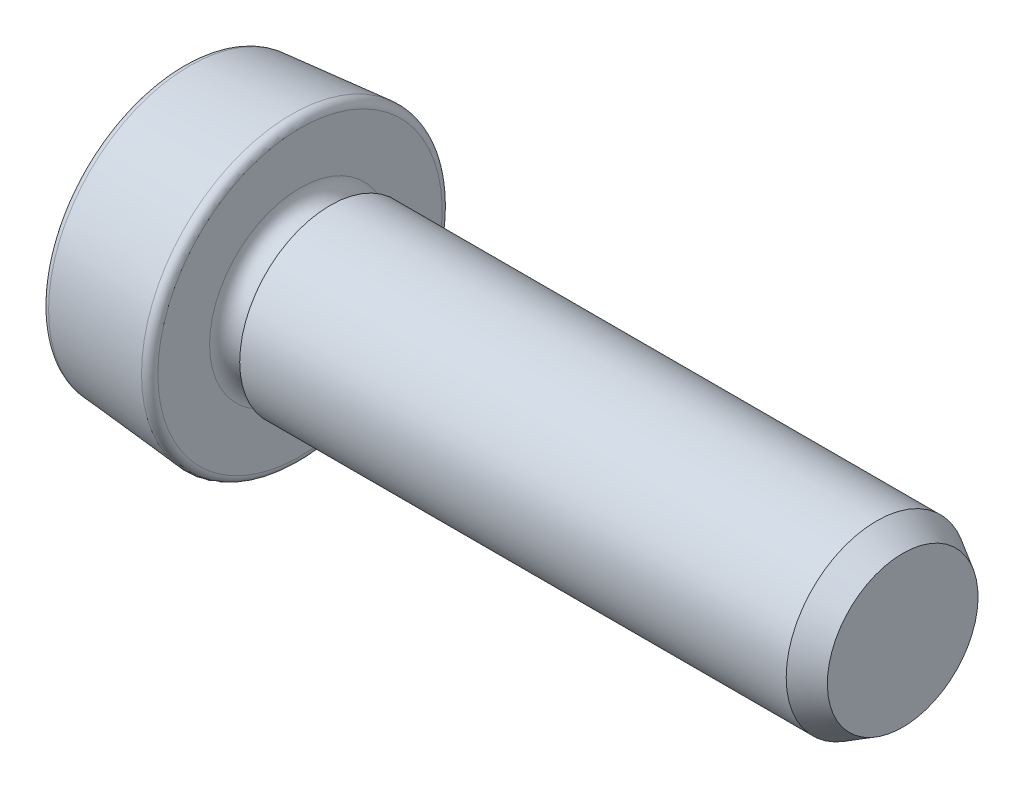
ISO-10303-21;
HEADER;
FILE_DESCRIPTION(('STEP AP214'),'2;1');
FILE_NAME('part.step','',(''),(''),'','','');
FILE_SCHEMA(('AUTOMOTIVE_DESIGN { 1 0 10303 214 1 1 1 1 }'));
ENDSEC;
DATA;
#1=APPLICATION_CONTEXT('core data for automotive mechanical design processes');
#2=APPLICATION_PROTOCOL_DEFINITION('international standard','automotive_design',2000,#1);
#3=PRODUCT_CONTEXT('',#1,'mechanical');
#4=PRODUCT('Part','Part','',(#3));
#5=PRODUCT_RELATED_PRODUCT_CATEGORY('part','',(#4));
#6=PRODUCT_DEFINITION_FORMATION('','',#4);
#7=PRODUCT_DEFINITION_CONTEXT('part definition',#1,'design');
#8=PRODUCT_DEFINITION('design','',#6,#7);
#9=PRODUCT_DEFINITION_SHAPE('','',#8);
#10=(LENGTH_UNIT() NAMED_UNIT(*) SI_UNIT(.MILLI.,.METRE.));
#11=(NAMED_UNIT(*) PLANE_ANGLE_UNIT() SI_UNIT($,.RADIAN.));
#12=(NAMED_UNIT(*) SI_UNIT($,.STERADIAN.) SOLID_ANGLE_UNIT());
#13=UNCERTAINTY_MEASURE_WITH_UNIT(LENGTH_MEASURE(1.E-05),#10,'distance_accuracy_value','');
#14=(GEOMETRIC_REPRESENTATION_CONTEXT(3) GLOBAL_UNCERTAINTY_ASSIGNED_CONTEXT((#13)) GLOBAL_UNIT_ASSIGNED_CONTEXT((#10,
#11,#12)) REPRESENTATION_CONTEXT('',''));
#15=CARTESIAN_POINT('',(0.,0.,0.));
#16=DIRECTION('',(0.,0.,1.));
#17=DIRECTION('',(1.,0.,0.));
#18=AXIS2_PLACEMENT_3D('',#15,#16,#17);
#19=CARTESIAN_POINT('',(0.,4.65879421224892,0.));
#20=DIRECTION('',(1.,0.,0.));
#21=DIRECTION('',(0.,0.,-1.));
#22=AXIS2_PLACEMENT_3D('',#19,#20,#21);
#23=PLANE('',#22);
#24=CARTESIAN_POINT('',(0.,0.,0.));
#25=DIRECTION('',(1.,0.,0.));
#26=DIRECTION('',(0.,0.,-1.));
#27=AXIS2_PLACEMENT_3D('',#24,#25,#26);
#28=CIRCLE('',#27,4.42054810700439);
#29=CARTESIAN_POINT('',(0.,0.,-4.42054810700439));
#30=VERTEX_POINT('',#29);
#31=EDGE_CURVE('E12',#30,#30,#28,.F.);
#32=ORIENTED_EDGE('',*,*,#31,.T.);
#33=EDGE_LOOP('',(#32));
#34=FACE_BOUND('',#33,.T.);
#35=DIRECTION('',(0.,0.5,0.866025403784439));
#36=VECTOR('',#35,1.);
#37=CARTESIAN_POINT('',(0.,1.0375,-1.79700271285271));
#38=LINE('',#37,#36);
#39=CARTESIAN_POINT('',(0.,1.0375,-1.79700271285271));
#40=VERTEX_POINT('',#39);
#41=CARTESIAN_POINT('',(0.,2.075,0.));
#42=VERTEX_POINT('',#41);
#43=EDGE_CURVE('E58',#40,#42,#38,.T.);
#44=ORIENTED_EDGE('',*,*,#43,.T.);
#45=DIRECTION('',(0.,-0.5,0.866025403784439));
#46=VECTOR('',#45,1.);
#47=CARTESIAN_POINT('',(0.,2.075,0.));
#48=LINE('',#47,#46);
#49=CARTESIAN_POINT('',(0.,1.0375,1.79700271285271));
#50=VERTEX_POINT('',#49);
#51=EDGE_CURVE('E118',#42,#50,#48,.T.);
#52=ORIENTED_EDGE('',*,*,#51,.T.);
#53=DIRECTION('',(0.,-1.,0.));
#54=VECTOR('',#53,1.);
#55=CARTESIAN_POINT('',(0.,1.0375,1.79700271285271));
#56=LINE('',#55,#54);
#57=CARTESIAN_POINT('',(0.,-1.0375,1.79700271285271));
#58=VERTEX_POINT('',#57);
#59=EDGE_CURVE('E116',#50,#58,#56,.T.);
#60=ORIENTED_EDGE('',*,*,#59,.T.);
#61=DIRECTION('',(0.,-0.5,-0.866025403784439));
#62=VECTOR('',#61,1.);
#63=CARTESIAN_POINT('',(0.,-1.0375,1.79700271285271));
#64=LINE('',#63,#62);
#65=CARTESIAN_POINT('',(0.,-2.075,0.));
#66=VERTEX_POINT('',#65);
#67=EDGE_CURVE('E95',#58,#66,#64,.T.);
#68=ORIENTED_EDGE('',*,*,#67,.T.);
#69=DIRECTION('',(0.,0.5,-0.866025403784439));
#70=VECTOR('',#69,1.);
#71=CARTESIAN_POINT('',(0.,-2.075,0.));
#72=LINE('',#71,#70);
#73=CARTESIAN_POINT('',(0.,-1.0375,-1.79700271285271));
#74=VERTEX_POINT('',#73);
#75=EDGE_CURVE('E106',#66,#74,#72,.T.);
#76=ORIENTED_EDGE('',*,*,#75,.T.);
#77=DIRECTION('',(0.,1.,0.));
#78=VECTOR('',#77,1.);
#79=CARTESIAN_POINT('',(0.,-1.0375,-1.79700271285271));
#80=LINE('',#79,#78);
#81=EDGE_CURVE('E112',#74,#40,#80,.T.);
#82=ORIENTED_EDGE('',*,*,#81,.T.);
#83=EDGE_LOOP('',(#44,#52,#60,#68,#76,#82));
#84=FACE_BOUND('',#83,.T.);
#85=ADVANCED_FACE('F43',(#34,#84),#23,.F.);
#86=CARTESIAN_POINT('',(3.9,0.,0.));
#87=DIRECTION('',(1.,0.,0.));
#88=DIRECTION('',(0.,0.,-1.));
#89=AXIS2_PLACEMENT_3D('',#86,#87,#88);
#90=CONICAL_SURFACE('',#89,5.,0.0872664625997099);
#91=CARTESIAN_POINT('',(3.61733950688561,0.,0.));
#92=DIRECTION('',(-1.,0.,0.));
#93=DIRECTION('',(0.,0.,1.));
#94=AXIS2_PLACEMENT_3D('',#91,#92,#93);
#95=CIRCLE('',#94,4.97527041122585);
#96=CARTESIAN_POINT('',(3.61733950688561,0.,4.97527041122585));
#97=VERTEX_POINT('',#96);
#98=EDGE_CURVE('E241',#97,#97,#95,.T.);
#99=ORIENTED_EDGE('',*,*,#98,.T.);
#100=EDGE_LOOP('',(#99));
#101=FACE_BOUND('',#100,.T.);
#102=CARTESIAN_POINT('',(0.237339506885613,0.,0.));
#103=DIRECTION('',(-1.,0.,0.));
#104=DIRECTION('',(0.,0.,1.));
#105=AXIS2_PLACEMENT_3D('',#102,#103,#104);
#106=CIRCLE('',#105,4.67955872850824);
#107=CARTESIAN_POINT('',(0.237339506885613,0.,4.67955872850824));
#108=VERTEX_POINT('',#107);
#109=EDGE_CURVE('E233',#108,#108,#106,.F.);
#110=ORIENTED_EDGE('',*,*,#109,.T.);
#111=EDGE_LOOP('',(#110));
#112=FACE_BOUND('',#111,.T.);
#113=ADVANCED_FACE('F253',(#101,#112),#90,.T.);
#114=CARTESIAN_POINT('',(3.9,3.,0.));
#115=DIRECTION('',(-1.,0.,0.));
#116=DIRECTION('',(0.,0.,1.));
#117=AXIS2_PLACEMENT_3D('',#114,#115,#116);
#118=PLANE('',#117);
#119=CARTESIAN_POINT('',(3.9,0.,0.));
#120=DIRECTION('',(-1.,0.,0.));
#121=DIRECTION('',(0.,0.,1.));
#122=AXIS2_PLACEMENT_3D('',#119,#120,#121);
#123=CIRCLE('',#122,4.71625978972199);
#124=CARTESIAN_POINT('',(3.9,0.,4.71625978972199));
#125=VERTEX_POINT('',#124);
#126=EDGE_CURVE('E51',#125,#125,#123,.F.);
#127=ORIENTED_EDGE('',*,*,#126,.T.);
#128=EDGE_LOOP('',(#127));
#129=FACE_BOUND('',#128,.T.);
#130=CARTESIAN_POINT('',(3.9,0.,0.));
#131=DIRECTION('',(1.,0.,0.));
#132=DIRECTION('',(0.,0.,-1.));
#133=AXIS2_PLACEMENT_3D('',#130,#131,#132);
#134=CIRCLE('',#133,3.);
#135=CARTESIAN_POINT('',(3.9,0.,-3.));
#136=VERTEX_POINT('',#135);
#137=EDGE_CURVE('E287',#136,#136,#134,.T.);
#138=ORIENTED_EDGE('',*,*,#137,.F.);
#139=EDGE_LOOP('',(#138));
#140=FACE_BOUND('',#139,.T.);
#141=ADVANCED_FACE('F157',(#129,#140),#118,.F.);
#142=CARTESIAN_POINT('',(2.,1.0375,-1.79700271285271));
#143=DIRECTION('',(0.,-0.866025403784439,0.5));
#144=DIRECTION('',(0.,-0.5,-0.866025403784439));
#145=AXIS2_PLACEMENT_3D('',#142,#143,#144);
#146=PLANE('',#145);
#147=ORIENTED_EDGE('',*,*,#43,.F.);
#148=DIRECTION('',(-1.,0.,0.));
#149=VECTOR('',#148,1.);
#150=CARTESIAN_POINT('',(2.,1.0375,-1.79700271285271));
#151=LINE('',#150,#149);
#152=CARTESIAN_POINT('',(2.,1.0375,-1.79700271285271));
#153=VERTEX_POINT('',#152);
#154=EDGE_CURVE('E166',#153,#40,#151,.T.);
#155=ORIENTED_EDGE('',*,*,#154,.F.);
#156=CARTESIAN_POINT('',(2.,1.0375,-1.79700271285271));
#157=DIRECTION('',(0.,0.5,0.866025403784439));
#158=VECTOR('',#157,1.);
#159=LINE('',#156,#158);
#160=CARTESIAN_POINT('',(2.,2.075,0.));
#161=VERTEX_POINT('',#160);
#162=EDGE_CURVE('E123',#153,#161,#159,.T.);
#163=ORIENTED_EDGE('',*,*,#162,.T.);
#164=DIRECTION('',(-1.,0.,0.));
#165=VECTOR('',#164,1.);
#166=CARTESIAN_POINT('',(2.,2.075,0.));
#167=LINE('',#166,#165);
#168=EDGE_CURVE('E126',#161,#42,#167,.T.);
#169=ORIENTED_EDGE('',*,*,#168,.T.);
#170=EDGE_LOOP('',(#147,#155,#163,#169));
#171=FACE_BOUND('',#170,.T.);
#172=ADVANCED_FACE('F151',(#171),#146,.T.);
#173=CARTESIAN_POINT('',(2.,2.075,0.));
#174=DIRECTION('',(0.,-0.866025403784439,-0.5));
#175=DIRECTION('',(0.,0.5,-0.866025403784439));
#176=AXIS2_PLACEMENT_3D('',#173,#174,#175);
#177=PLANE('',#176);
#178=ORIENTED_EDGE('',*,*,#51,.F.);
#179=ORIENTED_EDGE('',*,*,#168,.F.);
#180=CARTESIAN_POINT('',(2.,2.075,0.));
#181=DIRECTION('',(0.,-0.5,0.866025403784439));
#182=VECTOR('',#181,1.);
#183=LINE('',#180,#182);
#184=CARTESIAN_POINT('',(2.,1.0375,1.79700271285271));
#185=VERTEX_POINT('',#184);
#186=EDGE_CURVE('E133',#161,#185,#183,.T.);
#187=ORIENTED_EDGE('',*,*,#186,.T.);
#188=DIRECTION('',(-1.,0.,0.));
#189=VECTOR('',#188,1.);
#190=CARTESIAN_POINT('',(2.,1.0375,1.79700271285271));
#191=LINE('',#190,#189);
#192=EDGE_CURVE('E124',#185,#50,#191,.T.);
#193=ORIENTED_EDGE('',*,*,#192,.T.);
#194=EDGE_LOOP('',(#178,#179,#187,#193));
#195=FACE_BOUND('',#194,.T.);
#196=ADVANCED_FACE('F140',(#195),#177,.T.);
#197=CARTESIAN_POINT('',(2.,1.0375,1.79700271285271));
#198=DIRECTION('',(0.,0.,-1.));
#199=DIRECTION('',(0.,1.,0.));
#200=AXIS2_PLACEMENT_3D('',#197,#198,#199);
#201=PLANE('',#200);
#202=ORIENTED_EDGE('',*,*,#59,.F.);
#203=ORIENTED_EDGE('',*,*,#192,.F.);
#204=CARTESIAN_POINT('',(2.,1.0375,1.79700271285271));
#205=DIRECTION('',(0.,-1.,0.));
#206=VECTOR('',#205,1.);
#207=LINE('',#204,#206);
#208=CARTESIAN_POINT('',(2.,-1.0375,1.79700271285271));
#209=VERTEX_POINT('',#208);
#210=EDGE_CURVE('E229',#185,#209,#207,.T.);
#211=ORIENTED_EDGE('',*,*,#210,.T.);
#212=DIRECTION('',(-1.,0.,0.));
#213=VECTOR('',#212,1.);
#214=CARTESIAN_POINT('',(2.,-1.0375,1.79700271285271));
#215=LINE('',#214,#213);
#216=EDGE_CURVE('E102',#209,#58,#215,.T.);
#217=ORIENTED_EDGE('',*,*,#216,.T.);
#218=EDGE_LOOP('',(#202,#203,#211,#217));
#219=FACE_BOUND('',#218,.T.);
#220=ADVANCED_FACE('F150',(#219),#201,.T.);
#221=CARTESIAN_POINT('',(2.,-1.0375,1.79700271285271));
#222=DIRECTION('',(0.,0.866025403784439,-0.5));
#223=DIRECTION('',(0.,0.5,0.866025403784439));
#224=AXIS2_PLACEMENT_3D('',#221,#222,#223);
#225=PLANE('',#224);
#226=ORIENTED_EDGE('',*,*,#67,.F.);
#227=ORIENTED_EDGE('',*,*,#216,.F.);
#228=CARTESIAN_POINT('',(2.,-1.0375,1.79700271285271));
#229=DIRECTION('',(0.,-0.5,-0.866025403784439));
#230=VECTOR('',#229,1.);
#231=LINE('',#228,#230);
#232=CARTESIAN_POINT('',(2.,-2.075,0.));
#233=VERTEX_POINT('',#232);
#234=EDGE_CURVE('E98',#209,#233,#231,.T.);
#235=ORIENTED_EDGE('',*,*,#234,.T.);
#236=DIRECTION('',(-1.,0.,0.));
#237=VECTOR('',#236,1.);
#238=CARTESIAN_POINT('',(2.,-2.075,0.));
#239=LINE('',#238,#237);
#240=EDGE_CURVE('E90',#233,#66,#239,.T.);
#241=ORIENTED_EDGE('',*,*,#240,.T.);
#242=EDGE_LOOP('',(#226,#227,#235,#241));
#243=FACE_BOUND('',#242,.T.);
#244=ADVANCED_FACE('F92',(#243),#225,.T.);
#245=CARTESIAN_POINT('',(2.,-2.075,0.));
#246=DIRECTION('',(0.,0.866025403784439,0.5));
#247=DIRECTION('',(0.,-0.5,0.866025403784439));
#248=AXIS2_PLACEMENT_3D('',#245,#246,#247);
#249=PLANE('',#248);
#250=ORIENTED_EDGE('',*,*,#75,.F.);
#251=ORIENTED_EDGE('',*,*,#240,.F.);
#252=CARTESIAN_POINT('',(2.,-2.075,0.));
#253=DIRECTION('',(0.,0.5,-0.866025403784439));
#254=VECTOR('',#253,1.);
#255=LINE('',#252,#254);
#256=CARTESIAN_POINT('',(2.,-1.0375,-1.79700271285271));
#257=VERTEX_POINT('',#256);
#258=EDGE_CURVE('E341',#233,#257,#255,.T.);
#259=ORIENTED_EDGE('',*,*,#258,.T.);
#260=DIRECTION('',(-1.,0.,0.));
#261=VECTOR('',#260,1.);
#262=CARTESIAN_POINT('',(2.,-1.0375,-1.79700271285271));
#263=LINE('',#262,#261);
#264=EDGE_CURVE('E103',#257,#74,#263,.T.);
#265=ORIENTED_EDGE('',*,*,#264,.T.);
#266=EDGE_LOOP('',(#250,#251,#259,#265));
#267=FACE_BOUND('',#266,.T.);
#268=ADVANCED_FACE('F107',(#267),#249,.T.);
#269=CARTESIAN_POINT('',(2.,-1.0375,-1.79700271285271));
#270=DIRECTION('',(0.,0.,1.));
#271=DIRECTION('',(0.,-1.,0.));
#272=AXIS2_PLACEMENT_3D('',#269,#270,#271);
#273=PLANE('',#272);
#274=ORIENTED_EDGE('',*,*,#81,.F.);
#275=ORIENTED_EDGE('',*,*,#264,.F.);
#276=CARTESIAN_POINT('',(2.,-1.0375,-1.79700271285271));
#277=DIRECTION('',(0.,1.,0.));
#278=VECTOR('',#277,1.);
#279=LINE('',#276,#278);
#280=EDGE_CURVE('E173',#257,#153,#279,.T.);
#281=ORIENTED_EDGE('',*,*,#280,.T.);
#282=ORIENTED_EDGE('',*,*,#154,.T.);
#283=EDGE_LOOP('',(#274,#275,#281,#282));
#284=FACE_BOUND('',#283,.T.);
#285=ADVANCED_FACE('F186',(#284),#273,.T.);
#286=CARTESIAN_POINT('',(2.,2.075,0.));
#287=DIRECTION('',(0.873813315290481,0.4211148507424,-0.243130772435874));
#288=DIRECTION('',(-0.434141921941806,0.900844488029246,0.));
#289=AXIS2_PLACEMENT_3D('',#286,#287,#288);
#290=PLANE('',#289);
#291=DIRECTION('',(0.434141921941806,-0.900844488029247,0.));
#292=VECTOR('',#291,1.);
#293=CARTESIAN_POINT('',(2.,2.075,0.));
#294=LINE('',#293,#292);
#295=CARTESIAN_POINT('',(3.,0.,0.));
#296=VERTEX_POINT('',#295);
#297=EDGE_CURVE('E382',#161,#296,#294,.T.);
#298=ORIENTED_EDGE('',*,*,#297,.F.);
#299=ORIENTED_EDGE('',*,*,#162,.F.);
#300=DIRECTION('',(0.434141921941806,-0.450422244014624,0.780154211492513));
#301=VECTOR('',#300,1.);
#302=CARTESIAN_POINT('',(2.,1.0375,-1.79700271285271));
#303=LINE('',#302,#301);
#304=EDGE_CURVE('E361',#153,#296,#303,.T.);
#305=ORIENTED_EDGE('',*,*,#304,.T.);
#306=EDGE_LOOP('',(#298,#299,#305));
#307=FACE_BOUND('',#306,.T.);
#308=ADVANCED_FACE('F196',(#307),#290,.F.);
#309=CARTESIAN_POINT('',(2.,1.0375,-1.79700271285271));
#310=DIRECTION('',(0.873813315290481,0.,-0.486261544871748));
#311=DIRECTION('',(-0.486261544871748,0.,-0.873813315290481));
#312=AXIS2_PLACEMENT_3D('',#309,#310,#311);
#313=PLANE('',#312);
#314=ORIENTED_EDGE('',*,*,#304,.F.);
#315=ORIENTED_EDGE('',*,*,#280,.F.);
#316=DIRECTION('',(0.434141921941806,0.450422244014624,0.780154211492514));
#317=VECTOR('',#316,1.);
#318=CARTESIAN_POINT('',(2.,-1.0375,-1.79700271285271));
#319=LINE('',#318,#317);
#320=EDGE_CURVE('E290',#257,#296,#319,.T.);
#321=ORIENTED_EDGE('',*,*,#320,.T.);
#322=EDGE_LOOP('',(#314,#315,#321));
#323=FACE_BOUND('',#322,.T.);
#324=ADVANCED_FACE('F363',(#323),#313,.F.);
#325=CARTESIAN_POINT('',(2.,1.0375,1.79700271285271));
#326=DIRECTION('',(0.873813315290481,0.4211148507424,0.243130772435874));
#327=DIRECTION('',(-0.434141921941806,0.900844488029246,0.));
#328=AXIS2_PLACEMENT_3D('',#325,#326,#327);
#329=PLANE('',#328);
#330=DIRECTION('',(0.434141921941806,-0.450422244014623,-0.780154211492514));
#331=VECTOR('',#330,1.);
#332=CARTESIAN_POINT('',(2.,1.0375,1.79700271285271));
#333=LINE('',#332,#331);
#334=EDGE_CURVE('E67',#185,#296,#333,.T.);
#335=ORIENTED_EDGE('',*,*,#334,.F.);
#336=ORIENTED_EDGE('',*,*,#186,.F.);
#337=ORIENTED_EDGE('',*,*,#297,.T.);
#338=EDGE_LOOP('',(#335,#336,#337));
#339=FACE_BOUND('',#338,.T.);
#340=ADVANCED_FACE('F315',(#339),#329,.F.);
#341=CARTESIAN_POINT('',(2.,-1.0375,1.79700271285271));
#342=DIRECTION('',(0.873813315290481,0.,0.486261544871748));
#343=DIRECTION('',(0.486261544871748,0.,-0.873813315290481));
#344=AXIS2_PLACEMENT_3D('',#341,#342,#343);
#345=PLANE('',#344);
#346=DIRECTION('',(0.434141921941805,0.450422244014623,-0.780154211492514));
#347=VECTOR('',#346,1.);
#348=CARTESIAN_POINT('',(2.,-1.0375,1.79700271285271));
#349=LINE('',#348,#347);
#350=EDGE_CURVE('E303',#209,#296,#349,.T.);
#351=ORIENTED_EDGE('',*,*,#350,.F.);
#352=ORIENTED_EDGE('',*,*,#210,.F.);
#353=ORIENTED_EDGE('',*,*,#334,.T.);
#354=EDGE_LOOP('',(#351,#352,#353));
#355=FACE_BOUND('',#354,.T.);
#356=ADVANCED_FACE('F305',(#355),#345,.F.);
#357=CARTESIAN_POINT('',(2.,-2.075,0.));
#358=DIRECTION('',(0.873813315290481,-0.4211148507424,0.243130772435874));
#359=DIRECTION('',(0.434141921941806,0.900844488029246,0.));
#360=AXIS2_PLACEMENT_3D('',#357,#358,#359);
#361=PLANE('',#360);
#362=DIRECTION('',(0.434141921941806,0.900844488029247,0.));
#363=VECTOR('',#362,1.);
#364=CARTESIAN_POINT('',(2.,-2.075,0.));
#365=LINE('',#364,#363);
#366=EDGE_CURVE('E327',#233,#296,#365,.T.);
#367=ORIENTED_EDGE('',*,*,#366,.F.);
#368=ORIENTED_EDGE('',*,*,#234,.F.);
#369=ORIENTED_EDGE('',*,*,#350,.T.);
#370=EDGE_LOOP('',(#367,#368,#369));
#371=FACE_BOUND('',#370,.T.);
#372=ADVANCED_FACE('F314',(#371),#361,.F.);
#373=CARTESIAN_POINT('',(2.,-1.0375,-1.79700271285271));
#374=DIRECTION('',(0.873813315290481,-0.4211148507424,-0.243130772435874));
#375=DIRECTION('',(0.434141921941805,0.900844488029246,0.));
#376=AXIS2_PLACEMENT_3D('',#373,#374,#375);
#377=PLANE('',#376);
#378=ORIENTED_EDGE('',*,*,#320,.F.);
#379=ORIENTED_EDGE('',*,*,#258,.F.);
#380=ORIENTED_EDGE('',*,*,#366,.T.);
#381=EDGE_LOOP('',(#378,#379,#380));
#382=FACE_BOUND('',#381,.T.);
#383=ADVANCED_FACE('F197',(#382),#377,.F.);
#384=CARTESIAN_POINT('',(3.64,0.,0.));
#385=DIRECTION('',(-1.,0.,0.));
#386=DIRECTION('',(0.,0.,1.));
#387=AXIS2_PLACEMENT_3D('',#384,#385,#386);
#388=TOROIDAL_SURFACE('',#387,4.71625978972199,0.26);
#389=ORIENTED_EDGE('',*,*,#126,.F.);
#390=EDGE_LOOP('',(#389));
#391=FACE_BOUND('',#390,.T.);
#392=ORIENTED_EDGE('',*,*,#98,.F.);
#393=EDGE_LOOP('',(#392));
#394=FACE_BOUND('',#393,.T.);
#395=ADVANCED_FACE('F248',(#391,#394),#388,.T.);
#396=CARTESIAN_POINT('',(0.26,0.,0.));
#397=DIRECTION('',(1.,0.,0.));
#398=DIRECTION('',(0.,0.,-1.));
#399=AXIS2_PLACEMENT_3D('',#396,#397,#398);
#400=TOROIDAL_SURFACE('',#399,4.42054810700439,0.26);
#401=ORIENTED_EDGE('',*,*,#109,.F.);
#402=EDGE_LOOP('',(#401));
#403=FACE_BOUND('',#402,.T.);
#404=ORIENTED_EDGE('',*,*,#31,.F.);
#405=EDGE_LOOP('',(#404));
#406=FACE_BOUND('',#405,.T.);
#407=ADVANCED_FACE('F45',(#403,#406),#400,.T.);
#408=CARTESIAN_POINT('',(4.4,0.,0.));
#409=DIRECTION('',(1.,0.,0.));
#410=DIRECTION('',(0.,0.,-1.));
#411=AXIS2_PLACEMENT_3D('',#408,#409,#410);
#412=TOROIDAL_SURFACE('',#411,3.,0.5);
#413=CARTESIAN_POINT('',(4.9,0.,0.));
#414=DIRECTION('',(1.,0.,0.));
#415=DIRECTION('',(0.,0.,-1.));
#416=AXIS2_PLACEMENT_3D('',#413,#414,#415);
#417=CIRCLE('',#416,3.);
#418=CARTESIAN_POINT('',(4.9,0.,-3.));
#419=VERTEX_POINT('',#418);
#420=EDGE_CURVE('E282',#419,#419,#417,.T.);
#421=ORIENTED_EDGE('',*,*,#420,.F.);
#422=EDGE_LOOP('',(#421));
#423=FACE_BOUND('',#422,.T.);
#424=ORIENTED_EDGE('',*,*,#137,.T.);
#425=EDGE_LOOP('',(#424));
#426=FACE_BOUND('',#425,.T.);
#427=ADVANCED_FACE('F261',(#423,#426),#412,.F.);
#428=CARTESIAN_POINT('',(23.9,0.,0.));
#429=DIRECTION('',(-1.,0.,0.));
#430=DIRECTION('',(0.,0.,1.));
#431=AXIS2_PLACEMENT_3D('',#428,#429,#430);
#432=PLANE('',#431);
#433=CARTESIAN_POINT('',(23.9,0.,0.));
#434=DIRECTION('',(1.,0.,0.));
#435=DIRECTION('',(0.,1.,0.));
#436=AXIS2_PLACEMENT_3D('',#433,#434,#435);
#437=CIRCLE('',#436,2.5);
#438=CARTESIAN_POINT('',(23.9,2.5,0.));
#439=VERTEX_POINT('',#438);
#440=EDGE_CURVE('E286',#439,#439,#437,.T.);
#441=ORIENTED_EDGE('',*,*,#440,.T.);
#442=EDGE_LOOP('',(#441));
#443=FACE_BOUND('',#442,.T.);
#444=ADVANCED_FACE('F158',(#443),#432,.F.);
#445=CARTESIAN_POINT('',(23.9,0.,0.));
#446=DIRECTION('',(-1.,0.,0.));
#447=DIRECTION('',(0.,-1.,0.));
#448=AXIS2_PLACEMENT_3D('',#445,#446,#447);
#449=CONICAL_SURFACE('',#448,2.5,0.523598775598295);
#450=CARTESIAN_POINT('',(23.0339745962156,0.,0.));
#451=DIRECTION('',(1.,0.,0.));
#452=DIRECTION('',(0.,1.,0.));
#453=AXIS2_PLACEMENT_3D('',#450,#451,#452);
#454=CIRCLE('',#453,3.);
#455=CARTESIAN_POINT('',(23.0339745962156,3.,0.));
#456=VERTEX_POINT('',#455);
#457=EDGE_CURVE('E285',#456,#456,#454,.T.);
#458=ORIENTED_EDGE('',*,*,#457,.T.);
#459=EDGE_LOOP('',(#458));
#460=FACE_BOUND('',#459,.T.);
#461=ORIENTED_EDGE('',*,*,#440,.F.);
#462=EDGE_LOOP('',(#461));
#463=FACE_BOUND('',#462,.T.);
#464=ADVANCED_FACE('F272',(#460,#463),#449,.T.);
#465=CARTESIAN_POINT('',(-46.2685714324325,0.,0.));
#466=DIRECTION('',(-1.,0.,0.));
#467=DIRECTION('',(0.,0.,1.));
#468=AXIS2_PLACEMENT_3D('',#465,#466,#467);
#469=CYLINDRICAL_SURFACE('',#468,3.);
#470=ORIENTED_EDGE('',*,*,#420,.T.);
#471=EDGE_LOOP('',(#470));
#472=FACE_BOUND('',#471,.T.);
#473=ORIENTED_EDGE('',*,*,#457,.F.);
#474=EDGE_LOOP('',(#473));
#475=FACE_BOUND('',#474,.T.);
#476=ADVANCED_FACE('F270',(#472,#475),#469,.T.);
#477=CLOSED_SHELL('',(#85,#113,#141,#172,#196,#220,#244,#268,#285,#308,#324,#340,#356,#372,#383,
#395,#407,#427,#444,#464,#476));
#478=MANIFOLD_SOLID_BREP('B2',#477);
#479=ADVANCED_BREP_SHAPE_REPRESENTATION('',(#18,#478),#14);
#480=SHAPE_DEFINITION_REPRESENTATION(#9,#479);
ENDSEC;
END-ISO-10303-21;
